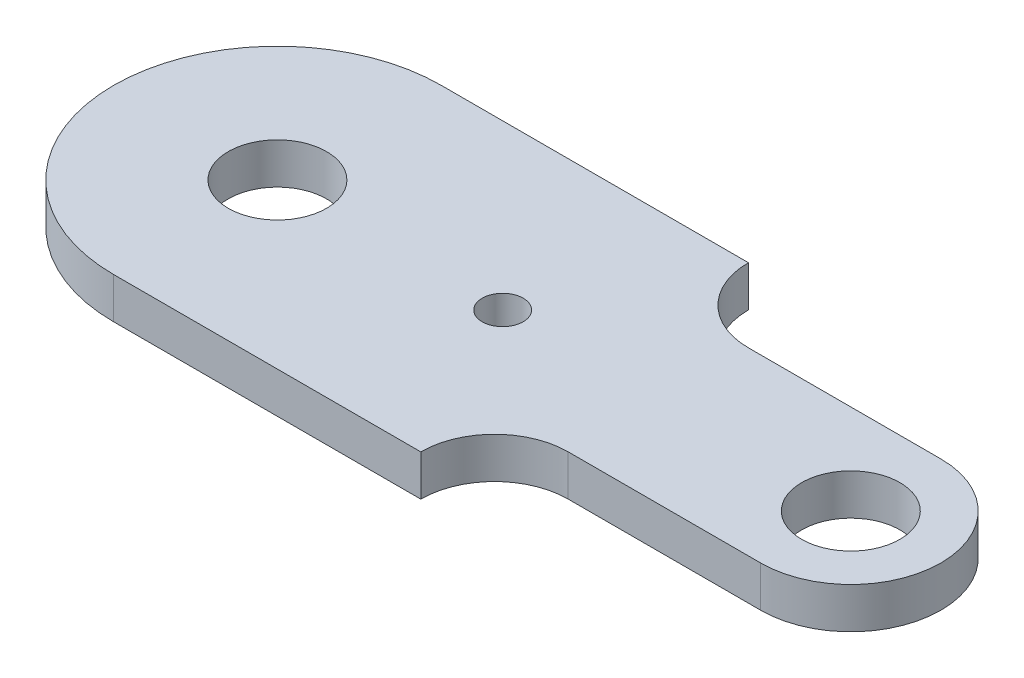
from build123d import *

# Parameters (mm, degrees)
SKETCH1_R           = 304.8
SKETCH1_R_2         = 127
BOSS_EXTRUDE1_DEPTH = 254


with BuildPart() as part:
    # Sketch1 → Boss-Extrude1 (new body)
    with BuildSketch(Plane(origin=(0, 0, 0), x_dir=(1, 0, 0), z_dir=(0, 1, 0))):
        with BuildLine():
            Line((0, 1016), (1905, 1016))
            ThreePointArc((1905, 1016), (2038.910779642, 692.710779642), (2362.2, 558.8))
            Line((2362.2, 558.8), (3556, 558.8))
            ThreePointArc((3556, 558.8), (4114.8, 0), (3556, -558.8))
            Line((3556, -558.8), (2362.2, -558.8))
            ThreePointArc((2362.2, -558.8), (2038.910779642, -692.710779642), (1905, -1016))
            Line((1905, -1016), (0, -1016))
            ThreePointArc((0, -1016), (-1016, 0), (0, 1016))
        make_face()
        with Locations(Location((0, 0, 0), (0, 0, 270))):
            Circle(SKETCH1_R, mode=Mode.SUBTRACT)
        with Locations(Location((1397, 0, 0), (0, 0, 270))):
            Circle(SKETCH1_R_2, mode=Mode.SUBTRACT)
        with Locations(Location((3556, 0, 0), (0, 0, 270))):
            Circle(SKETCH1_R, mode=Mode.SUBTRACT)
    extrude(amount=BOSS_EXTRUDE1_DEPTH)


solid = part.part
